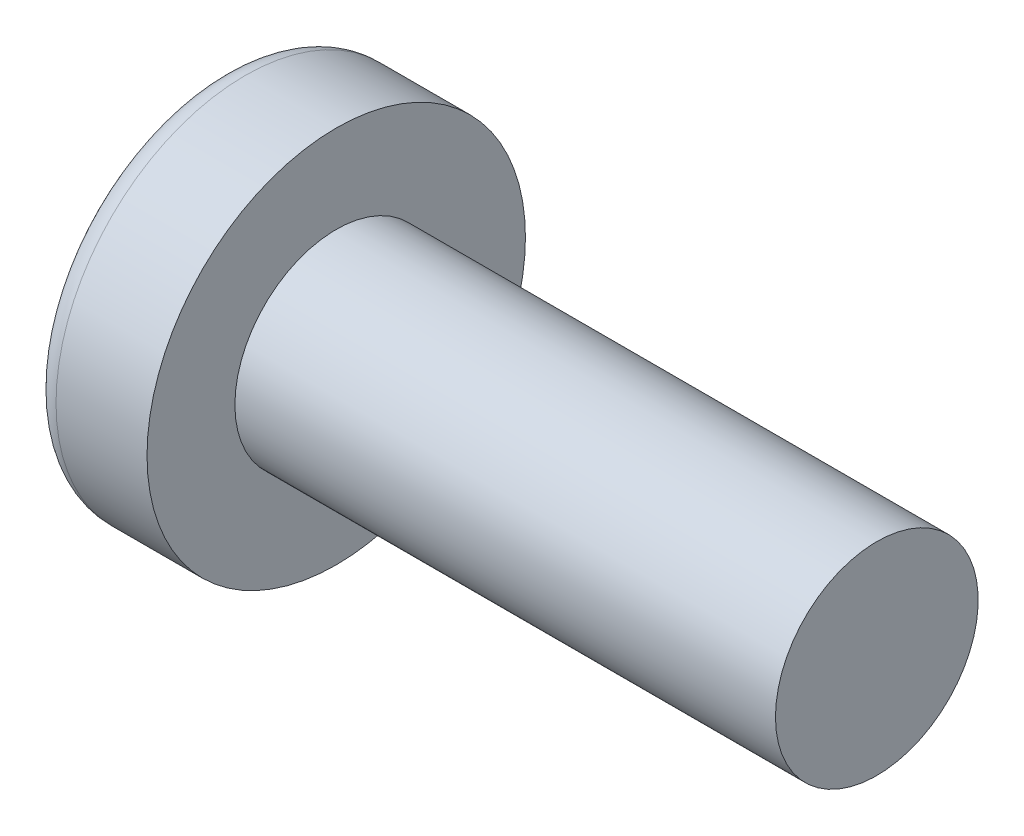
from build123d import *

# Parameters (mm, degrees)
CIRPATTERN1_COUNT = 2
CIRPATTERN1_ANGLE = 90


with BuildPart() as part:
    # BodySke → Base-Revolve (revolve)
    with BuildSketch(Plane.XY, mode=Mode.PRIVATE) as base_revolve_sk:
        with BuildLine():
            Line((2.4, 1.5), (2.4, 2.8))
            Line((2.4, 2.8), (1.053355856, 2.8))
            ThreePointArc((1.053355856, 2.8), (0.878072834, 2.754445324), (0.747150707, 2.629310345))
            ThreePointArc((0.747150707, 2.629310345), (0.190413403, 1.366702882), (0, 0))
            Line((0, 0), (10.4, 0))
            Line((10.4, 0), (10.4, 1.5))
            Line((10.4, 1.5), (2.4, 1.5))
        make_face()
    revolve(base_revolve_sk.sketch.rotate(Axis((-25.4, 0, 0), (1, 0, 0)), 90), axis=Axis((-25.4, 0, 0), (1, 0, 0)))

    # Sketch3 → Cut-Loft1 section 0
    with BuildSketch(Plane(origin=(0, 0, 0), x_dir=(0, 0, -1), z_dir=(1, 0, 0))):
        with BuildLine():
            Line((0.37, -1.45), (-0.37, -1.45))
            Line((-0.37, -1.45), (-0.37, 1.45))
            Line((-0.37, 1.45), (0.37, 1.45))
            Line((0.37, 1.45), (0.37, -1.45))
        make_face()
    # Sketch4 → Cut-Loft1 section 1
    with BuildSketch(Plane(origin=(1.76, 0, 0), x_dir=(0, 0, -1), z_dir=(1, 0, 0))):
        with BuildLine():
            Line((0.185, -0.185), (-0.185, -0.185))
            Line((-0.185, -0.185), (-0.185, 0.185))
            Line((-0.185, 0.185), (0.185, 0.185))
            Line((0.185, 0.185), (0.185, -0.185))
        make_face()
    cut_loft1 = loft(mode=Mode.SUBTRACT)

    # CirPattern1: Cut-Loft1 ×2 about axis
    cirpattern1_axis = Axis((0, 0, 0), (1, 0, 0))
    for i in range(1, CIRPATTERN1_COUNT):
        add(cut_loft1.rotate(cirpattern1_axis, i * CIRPATTERN1_ANGLE / (CIRPATTERN1_COUNT - 1)), mode=Mode.SUBTRACT)


solid = part.part
